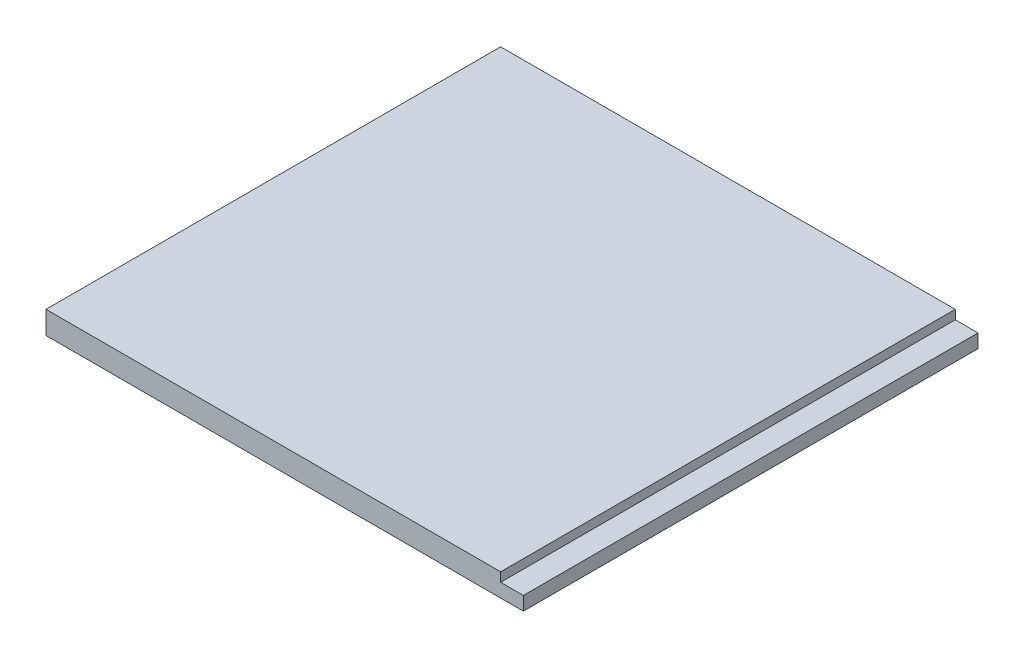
ISO-10303-21;
HEADER;
FILE_DESCRIPTION(('STEP AP214'),'2;1');
FILE_NAME('part.step','',(''),(''),'','','');
FILE_SCHEMA(('AUTOMOTIVE_DESIGN { 1 0 10303 214 1 1 1 1 }'));
ENDSEC;
DATA;
#1=APPLICATION_CONTEXT('core data for automotive mechanical design processes');
#2=APPLICATION_PROTOCOL_DEFINITION('international standard','automotive_design',2000,#1);
#3=PRODUCT_CONTEXT('',#1,'mechanical');
#4=PRODUCT('Part','Part','',(#3));
#5=PRODUCT_RELATED_PRODUCT_CATEGORY('part','',(#4));
#6=PRODUCT_DEFINITION_FORMATION('','',#4);
#7=PRODUCT_DEFINITION_CONTEXT('part definition',#1,'design');
#8=PRODUCT_DEFINITION('design','',#6,#7);
#9=PRODUCT_DEFINITION_SHAPE('','',#8);
#10=(LENGTH_UNIT() NAMED_UNIT(*) SI_UNIT(.MILLI.,.METRE.));
#11=(NAMED_UNIT(*) PLANE_ANGLE_UNIT() SI_UNIT($,.RADIAN.));
#12=(NAMED_UNIT(*) SI_UNIT($,.STERADIAN.) SOLID_ANGLE_UNIT());
#13=UNCERTAINTY_MEASURE_WITH_UNIT(LENGTH_MEASURE(1.E-05),#10,'distance_accuracy_value','');
#14=(GEOMETRIC_REPRESENTATION_CONTEXT(3) GLOBAL_UNCERTAINTY_ASSIGNED_CONTEXT((#13)) GLOBAL_UNIT_ASSIGNED_CONTEXT((#10,
#11,#12)) REPRESENTATION_CONTEXT('',''));
#15=CARTESIAN_POINT('',(0.,0.,0.));
#16=DIRECTION('',(0.,0.,1.));
#17=DIRECTION('',(1.,0.,0.));
#18=AXIS2_PLACEMENT_3D('',#15,#16,#17);
#19=CARTESIAN_POINT('',(1.22464679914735E-13,-1000.,10000.));
#20=DIRECTION('',(0.,1.,0.));
#21=DIRECTION('',(0.,0.,1.));
#22=AXIS2_PLACEMENT_3D('',#19,#20,#21);
#23=PLANE('',#22);
#24=DIRECTION('',(1.,0.,0.));
#25=VECTOR('',#24,1.);
#26=CARTESIAN_POINT('',(1.22464679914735E-13,-1000.,-10000.));
#27=LINE('',#26,#25);
#28=CARTESIAN_POINT('',(1.22464679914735E-13,-1000.,-10000.));
#29=VERTEX_POINT('',#28);
#30=CARTESIAN_POINT('',(21000.,-1000.,-10000.));
#31=VERTEX_POINT('',#30);
#32=EDGE_CURVE('E152',#29,#31,#27,.T.);
#33=ORIENTED_EDGE('',*,*,#32,.T.);
#34=DIRECTION('',(0.,0.,-1.));
#35=VECTOR('',#34,1.);
#36=CARTESIAN_POINT('',(21000.,-1000.,10000.));
#37=LINE('',#36,#35);
#38=CARTESIAN_POINT('',(21000.,-1000.,10000.));
#39=VERTEX_POINT('',#38);
#40=EDGE_CURVE('E137',#39,#31,#37,.T.);
#41=ORIENTED_EDGE('',*,*,#40,.F.);
#42=DIRECTION('',(1.,0.,0.));
#43=VECTOR('',#42,1.);
#44=CARTESIAN_POINT('',(1.22464679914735E-13,-1000.,10000.));
#45=LINE('',#44,#43);
#46=CARTESIAN_POINT('',(1.22464679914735E-13,-1000.,10000.));
#47=VERTEX_POINT('',#46);
#48=EDGE_CURVE('E125',#47,#39,#45,.T.);
#49=ORIENTED_EDGE('',*,*,#48,.F.);
#50=DIRECTION('',(0.,0.,-1.));
#51=VECTOR('',#50,1.);
#52=CARTESIAN_POINT('',(1.22464679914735E-13,-1000.,10000.));
#53=LINE('',#52,#51);
#54=EDGE_CURVE('E162',#47,#29,#53,.T.);
#55=ORIENTED_EDGE('',*,*,#54,.T.);
#56=EDGE_LOOP('',(#33,#41,#49,#55));
#57=FACE_BOUND('',#56,.T.);
#58=CARTESIAN_POINT('',(5352.16897662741,-1000.,-7379.55640049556));
#59=CARTESIAN_POINT('',(5358.21018918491,-1000.,-7391.61646283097));
#60=CARTESIAN_POINT('',(5370.45160175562,-1000.,-7415.695224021));
#61=CARTESIAN_POINT('',(5395.46174029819,-1000.,-7463.47331727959));
#62=CARTESIAN_POINT('',(5427.74635045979,-1000.,-7522.55773510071));
#63=CARTESIAN_POINT('',(5468.06123588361,-1000.,-7592.3462493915));
#64=CARTESIAN_POINT('',(5523.84880853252,-1000.,-7683.84644309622));
#65=CARTESIAN_POINT('',(5597.25963176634,-1000.,-7795.16917318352));
#66=CARTESIAN_POINT('',(5690.76106163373,-1000.,-7923.48728077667));
#67=CARTESIAN_POINT('',(5789.1594403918,-1000.,-8046.22757127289));
#68=CARTESIAN_POINT('',(5926.18417936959,-1000.,-8202.14924887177));
#69=CARTESIAN_POINT('',(6107.05516747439,-1000.,-8382.15540922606));
#70=CARTESIAN_POINT('',(6335.39351275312,-1000.,-8574.07379128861));
#71=CARTESIAN_POINT('',(6571.52797720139,-1000.,-8742.69466088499));
#72=CARTESIAN_POINT('',(6812.6814132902,-1000.,-8889.46900451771));
#73=CARTESIAN_POINT('',(7056.80770920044,-1000.,-9016.20855971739));
#74=CARTESIAN_POINT('',(7302.50638383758,-1000.,-9124.83409286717));
#75=CARTESIAN_POINT('',(7548.89368890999,-1000.,-9217.20929135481));
#76=CARTESIAN_POINT('',(7795.4685042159,-1000.,-9295.0445551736));
#77=CARTESIAN_POINT('',(8041.99387460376,-1000.,-9359.85279388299));
#78=CARTESIAN_POINT('',(8288.40227612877,-1000.,-9412.94374729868));
#79=CARTESIAN_POINT('',(8616.83219639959,-1000.,-9469.58203583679));
#80=CARTESIAN_POINT('',(9027.35480173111,-1000.,-9516.2670119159));
#81=CARTESIAN_POINT('',(9520.70494822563,-1000.,-9539.53348718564));
#82=CARTESIAN_POINT('',(10015.235133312,-1000.,-9534.08550202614));
#83=CARTESIAN_POINT('',(10510.9240952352,-1000.,-9502.85267393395));
#84=CARTESIAN_POINT('',(11007.2879401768,-1000.,-9447.99776160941));
#85=CARTESIAN_POINT('',(11503.447214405,-1000.,-9371.17076714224));
#86=CARTESIAN_POINT('',(11998.2108587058,-1000.,-9273.6604811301));
#87=CARTESIAN_POINT('',(12490.155834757,-1000.,-9156.4870970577));
#88=CARTESIAN_POINT('',(12977.6979204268,-1000.,-9020.45177911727));
#89=CARTESIAN_POINT('',(13459.1536875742,-1000.,-8866.15365810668));
#90=CARTESIAN_POINT('',(13853.8537017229,-1000.,-8722.68040532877));
#91=CARTESIAN_POINT('',(14164.8438112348,-1000.,-8599.03605899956));
#92=CARTESIAN_POINT('',(14395.4894696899,-1000.,-8501.85680552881));
#93=CARTESIAN_POINT('',(14585.358322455,-1000.,-8417.14315681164));
#94=CARTESIAN_POINT('',(14735.7464739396,-1000.,-8347.10641665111));
#95=CARTESIAN_POINT('',(14847.7692454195,-1000.,-8293.43142234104));
#96=CARTESIAN_POINT('',(14958.9586145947,-1000.,-8238.61494774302));
#97=CARTESIAN_POINT('',(15105.804027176,-1000.,-8164.13816756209));
#98=CARTESIAN_POINT('',(15286.8159355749,-1000.,-8068.386700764));
#99=CARTESIAN_POINT('',(15499.8658531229,-1000.,-7949.24914386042));
#100=CARTESIAN_POINT('',(15778.3077932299,-1000.,-7784.74382431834));
#101=CARTESIAN_POINT('',(16115.6412721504,-1000.,-7568.51107575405));
#102=CARTESIAN_POINT('',(16502.6909812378,-1000.,-7292.10509056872));
#103=CARTESIAN_POINT('',(16871.3043711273,-1000.,-6998.86995618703));
#104=CARTESIAN_POINT('',(17220.7203266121,-1000.,-6688.9834152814));
#105=CARTESIAN_POINT('',(17550.1104841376,-1000.,-6362.72488600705));
#106=CARTESIAN_POINT('',(17858.5954879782,-1000.,-6020.49470253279));
#107=CARTESIAN_POINT('',(18145.2669472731,-1000.,-5662.83021544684));
#108=CARTESIAN_POINT('',(18409.2151925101,-1000.,-5290.41619642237));
#109=CARTESIAN_POINT('',(18649.5611989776,-1000.,-4904.08767314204));
#110=CARTESIAN_POINT('',(18865.4902881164,-1000.,-4504.82326707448));
#111=CARTESIAN_POINT('',(19056.2851332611,-1000.,-4093.72990601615));
#112=CARTESIAN_POINT('',(19193.841789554,-1000.,-3742.30001786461));
#113=CARTESIAN_POINT('',(19290.8024719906,-1000.,-3456.48777450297));
#114=CARTESIAN_POINT('',(19345.9205707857,-1000.,-3276.03824869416));
#115=CARTESIAN_POINT('',(19386.7054989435,-1000.,-3130.69011510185));
#116=CARTESIAN_POINT('',(19415.6485959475,-1000.,-3021.15445877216));
#117=CARTESIAN_POINT('',(19442.8787680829,-1000.,-2911.38728726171));
#118=CARTESIAN_POINT('',(19476.9225418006,-1000.,-2764.79012264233));
#119=CARTESIAN_POINT('',(19515.2878033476,-1000.,-2581.13305553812));
#120=CARTESIAN_POINT('',(19567.9540814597,-1000.,-2286.64008814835));
#121=CARTESIAN_POINT('',(19617.8583576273,-1000.,-1917.71470504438));
#122=CARTESIAN_POINT('',(19653.5818427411,-1000.,-1474.80387685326));
#123=CARTESIAN_POINT('',(19666.4224556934,-1000.,-1032.59491612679));
#124=CARTESIAN_POINT('',(19657.5905092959,-1000.,-591.848916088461));
#125=CARTESIAN_POINT('',(19618.4128308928,-1000.,-7.00271869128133));
#126=CARTESIAN_POINT('',(19520.7032562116,-1000.,717.325154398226));
#127=CARTESIAN_POINT('',(19332.7766419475,-1000.,1571.73649485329));
#128=CARTESIAN_POINT('',(19080.1963400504,-1000.,2407.68512513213));
#129=CARTESIAN_POINT('',(18767.9716325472,-1000.,3221.46217048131));
#130=CARTESIAN_POINT('',(18400.2535024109,-1000.,4009.19359983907));
#131=CARTESIAN_POINT('',(18050.4228882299,-1000.,4640.51046706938));
#132=CARTESIAN_POINT('',(17745.8628769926,-1000.,5128.2934731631));
#133=CARTESIAN_POINT('',(17505.3563666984,-1000.,5484.91447624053));
#134=CARTESIAN_POINT('',(17295.0521966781,-1000.,5773.91821773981));
#135=CARTESIAN_POINT('',(17120.963325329,-1000.,5999.90152424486));
#136=CARTESIAN_POINT('',(17009.7405827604,-1000.,6138.89251894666));
#137=CARTESIAN_POINT('',(16919.3068962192,-1000.,6248.70818749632));
#138=CARTESIAN_POINT('',(16850.7858559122,-1000.,6330.33534066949));
#139=CARTESIAN_POINT('',(16781.4256293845,-1000.,6411.38395514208));
#140=CARTESIAN_POINT('',(16687.7611991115,-1000.,6518.70572810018));
#141=CARTESIAN_POINT('',(16568.4439042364,-1000.,6651.39900838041));
#142=CARTESIAN_POINT('',(16372.6030249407,-1000.,6860.41351675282));
#143=CARTESIAN_POINT('',(16118.2791027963,-1000.,7115.1227603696));
#144=CARTESIAN_POINT('',(15797.0655413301,-1000.,7408.95989841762));
#145=CARTESIAN_POINT('',(15459.2014184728,-1000.,7689.52828190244));
#146=CARTESIAN_POINT('',(15104.2594407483,-1000.,7955.27341512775));
#147=CARTESIAN_POINT('',(14732.0455194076,-1000.,8204.58231625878));
#148=CARTESIAN_POINT('',(14342.6160703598,-1000.,8435.84193466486));
#149=CARTESIAN_POINT('',(13936.2743970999,-1000.,8647.50726467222));
#150=CARTESIAN_POINT('',(13583.9967319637,-1000.,8806.39052032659));
#151=CARTESIAN_POINT('',(13294.3224360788,-1000.,8922.39130930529));
#152=CARTESIAN_POINT('',(13073.2372590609,-1000.,9003.71252017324));
#153=CARTESIAN_POINT('',(12848.4208043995,-1000.,9079.23976861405));
#154=CARTESIAN_POINT('',(12677.0842569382,-1000.,9131.46642921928));
#155=CARTESIAN_POINT('',(12561.7558038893,-1000.,9164.41771773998));
#156=CARTESIAN_POINT('',(12484.576599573,-1000.,9185.88582864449));
#157=CARTESIAN_POINT('',(12387.8267537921,-1000.,9211.7137146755));
#158=CARTESIAN_POINT('',(12271.2561736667,-1000.,9241.13523522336));
#159=CARTESIAN_POINT('',(12115.240899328,-1000.,9278.29419675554));
#160=CARTESIAN_POINT('',(11919.1551990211,-1000.,9320.91977506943));
#161=CARTESIAN_POINT('',(11682.2865932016,-1000.,9366.10778711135));
#162=CARTESIAN_POINT('',(11443.9909745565,-1000.,9405.46387374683));
#163=CARTESIAN_POINT('',(11124.5498057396,-1000.,9450.30699966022));
#164=CARTESIAN_POINT('',(10722.3933778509,-1000.,9492.28486172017));
#165=CARTESIAN_POINT('',(10236.420273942,-1000.,9520.65775033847));
#166=CARTESIAN_POINT('',(9748.28662547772,-1000.,9527.30632853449));
#167=CARTESIAN_POINT('',(9259.24902299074,-1000.,9512.30269366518));
#168=CARTESIAN_POINT('',(8770.58515000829,-1000.,9475.5241670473));
#169=CARTESIAN_POINT('',(8283.58335741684,-1000.,9416.65368711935));
#170=CARTESIAN_POINT('',(7799.53610719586,-1000.,9335.16623144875));
#171=CARTESIAN_POINT('',(7319.74056768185,-1000.,9230.30295225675));
#172=CARTESIAN_POINT('',(6845.51134350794,-1000.,9101.03278924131));
#173=CARTESIAN_POINT('',(6378.21262363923,-1000.,8946.00272850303));
#174=CARTESIAN_POINT('',(5919.32045926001,-1000.,8763.48043146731));
#175=CARTESIAN_POINT('',(5470.52967283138,-1000.,8551.29837725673));
#176=CARTESIAN_POINT('',(5033.92385018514,-1000.,8306.82023350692));
#177=CARTESIAN_POINT('',(4612.22286336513,-1000.,8026.96386790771));
#178=CARTESIAN_POINT('',(4209.11899538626,-1000.,7708.35357735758));
#179=CARTESIAN_POINT('',(3892.88356569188,-1000.,7407.76325715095));
#180=CARTESIAN_POINT('',(3655.07627599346,-1000.,7144.95308141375));
#181=CARTESIAN_POINT('',(3485.33276490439,-1000.,6936.50859562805));
#182=CARTESIAN_POINT('',(3325.28875191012,-1000.,6716.67255698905));
#183=CARTESIAN_POINT('',(3176.11396210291,-1000.,6485.56463983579));
#184=CARTESIAN_POINT('',(3061.8676543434,-1000.,6283.84120171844));
#185=CARTESIAN_POINT('',(2977.11317220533,-1000.,6117.24912740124));
#186=CARTESIAN_POINT('',(2917.01429914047,-1000.,5989.78704456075));
#187=CARTESIAN_POINT('',(2860.52448585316,-1000.,5859.90811284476));
#188=CARTESIAN_POINT('',(2816.56721187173,-1000.,5749.74802710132));
#189=CARTESIAN_POINT('',(2783.33945263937,-1000.,5660.54184360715));
#190=CARTESIAN_POINT('',(2759.39047195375,-1000.,5593.07317333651));
#191=CARTESIAN_POINT('',(2736.58784899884,-1000.,5525.55405521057));
#192=CARTESIAN_POINT('',(2707.66190228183,-1000.,5435.41713443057));
#193=CARTESIAN_POINT('',(2674.24526017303,-1000.,5322.61091378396));
#194=CARTESIAN_POINT('',(2638.38921911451,-1000.,5187.14002335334));
#195=CARTESIAN_POINT('',(2606.64144054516,-1000.,5051.67512600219));
#196=CARTESIAN_POINT('',(2569.60937442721,-1000.,4871.18532183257));
#197=CARTESIAN_POINT('',(2532.92323517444,-1000.,4646.0235030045));
#198=CARTESIAN_POINT('',(2503.26889286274,-1000.,4377.06672099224));
#199=CARTESIAN_POINT('',(2487.07465726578,-1000.,4109.7225260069));
#200=CARTESIAN_POINT('',(2482.35448799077,-1000.,3755.78193452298));
#201=CARTESIAN_POINT('',(2506.25792654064,-1000.,3318.61776963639));
#202=CARTESIAN_POINT('',(2578.00156468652,-1000.,2803.65522292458));
#203=CARTESIAN_POINT('',(2670.93756368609,-1000.,2383.36628350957));
#204=CARTESIAN_POINT('',(2764.08519763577,-1000.,2052.97871453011));
#205=CARTESIAN_POINT('',(2843.17097216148,-1000.,1808.26332685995));
#206=CARTESIAN_POINT('',(2931.34566552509,-1000.,1566.78933923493));
#207=CARTESIAN_POINT('',(3028.5302326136,-1000.,1328.74140629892));
#208=CARTESIAN_POINT('',(3117.00119331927,-1000.,1133.39349068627));
#209=CARTESIAN_POINT('',(3192.28034125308,-1000.,979.044411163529));
#210=CARTESIAN_POINT('',(3250.99906980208,-1000.,864.278750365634));
#211=CARTESIAN_POINT('',(3301.8236537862,-1000.,769.497039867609));
#212=CARTESIAN_POINT('',(3343.62459874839,-1000.,694.205006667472));
#213=CARTESIAN_POINT('',(3370.23022746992,-1000.,647.368945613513));
#214=CARTESIAN_POINT('',(3391.79721950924,-1000.,610.046459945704));
#215=CARTESIAN_POINT('',(3413.57580125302,-1000.,572.784205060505));
#216=CARTESIAN_POINT('',(3440.94889487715,-1000.,526.736266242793));
#217=CARTESIAN_POINT('',(3473.99247299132,-1000.,472.338489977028));
#218=CARTESIAN_POINT('',(3518.27728285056,-1000.,400.934221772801));
#219=CARTESIAN_POINT('',(3573.98371160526,-1000.,313.768524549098));
#220=CARTESIAN_POINT('',(3641.17066999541,-1000.,212.424733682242));
#221=CARTESIAN_POINT('',(3708.48621580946,-1000.,114.242585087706));
#222=CARTESIAN_POINT('',(3798.14692035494,-1000.,-12.5814865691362));
#223=CARTESIAN_POINT('',(3909.57137673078,-1000.,-163.700659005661));
#224=CARTESIAN_POINT('',(4040.84727704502,-1000.,-333.980969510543));
#225=CARTESIAN_POINT('',(4168.44373271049,-1000.,-493.95461059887));
#226=CARTESIAN_POINT('',(4332.1687707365,-1000.,-694.402664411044));
#227=CARTESIAN_POINT('',(4522.21370264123,-1000.,-922.367059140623));
#228=CARTESIAN_POINT('',(4686.7635035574,-1000.,-1122.82944089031));
#229=CARTESIAN_POINT('',(4800.31310951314,-1000.,-1267.09514512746));
#230=CARTESIAN_POINT('',(4875.94276670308,-1000.,-1367.12470143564));
#231=CARTESIAN_POINT('',(4941.69936555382,-1000.,-1458.79811007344));
#232=CARTESIAN_POINT('',(4997.47466037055,-1000.,-1541.85746684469));
#233=CARTESIAN_POINT('',(5043.43310591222,-1000.,-1616.05351924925));
#234=CARTESIAN_POINT('',(5080.05837156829,-1000.,-1681.24010421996));
#235=CARTESIAN_POINT('',(5108.17397749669,-1000.,-1737.50636447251));
#236=CARTESIAN_POINT('',(5123.73645506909,-1000.,-1773.3685820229));
#237=CARTESIAN_POINT('',(5132.24080849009,-1000.,-1794.95895078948));
#238=CARTESIAN_POINT('',(5136.1420260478,-1000.,-1805.31559757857));
#239=CARTESIAN_POINT('',(5139.71540295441,-1000.,-1815.25976134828));
#240=CARTESIAN_POINT('',(5142.98166009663,-1000.,-1824.81197309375));
#241=CARTESIAN_POINT('',(5145.97068013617,-1000.,-1834.03021453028));
#242=CARTESIAN_POINT('',(5148.67629244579,-1000.,-1842.8447821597));
#243=CARTESIAN_POINT('',(5151.51844651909,-1000.,-1852.65013518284));
#244=CARTESIAN_POINT('',(5155.39185063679,-1000.,-1866.84652438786));
#245=CARTESIAN_POINT('',(5160.37176851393,-1000.,-1886.82354880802));
#246=CARTESIAN_POINT('',(5166.39440437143,-1000.,-1914.38776395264));
#247=CARTESIAN_POINT('',(5172.30810306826,-1000.,-1945.56606151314));
#248=CARTESIAN_POINT('',(5179.85051074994,-1000.,-1991.92737606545));
#249=CARTESIAN_POINT('',(5188.29016663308,-1000.,-2058.75937544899));
#250=CARTESIAN_POINT('',(5195.92698255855,-1000.,-2152.56253163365));
#251=CARTESIAN_POINT('',(5200.42206088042,-1000.,-2259.1371253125));
#252=CARTESIAN_POINT('',(5201.69532676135,-1000.,-2417.0178260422));
#253=CARTESIAN_POINT('',(5193.87189100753,-1000.,-2641.50511197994));
#254=CARTESIAN_POINT('',(5169.91295660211,-1000.,-2946.82593784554));
#255=CARTESIAN_POINT('',(5133.93516444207,-1000.,-3281.70550411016));
#256=CARTESIAN_POINT('',(5089.70727030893,-1000.,-3641.18471928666));
#257=CARTESIAN_POINT('',(5041.88305240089,-1000.,-4021.85890690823));
#258=CARTESIAN_POINT('',(5003.53814648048,-1000.,-4355.31176577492));
#259=CARTESIAN_POINT('',(4976.99580408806,-1000.,-4631.96371888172));
#260=CARTESIAN_POINT('',(4960.11744780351,-1000.,-4844.66864350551));
#261=CARTESIAN_POINT('',(4947.34177115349,-1000.,-5062.97660885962));
#262=CARTESIAN_POINT('',(4939.93160593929,-1000.,-5287.44148517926));
#263=CARTESIAN_POINT('',(4939.39482039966,-1000.,-5518.76448464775));
#264=CARTESIAN_POINT('',(4947.56899672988,-1000.,-5757.76746400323));
#265=CARTESIAN_POINT('',(4966.72046085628,-1000.,-6005.32359567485));
#266=CARTESIAN_POINT('',(4999.65351153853,-1000.,-6262.21835599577));
#267=CARTESIAN_POINT('',(5041.43937571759,-1000.,-6484.48200780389));
#268=CARTESIAN_POINT('',(5085.5174015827,-1000.,-6667.08354237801));
#269=CARTESIAN_POINT('',(5124.46778553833,-1000.,-6806.28698283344));
#270=CARTESIAN_POINT('',(5169.88861328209,-1000.,-6947.52634689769));
#271=CARTESIAN_POINT('',(5213.62066002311,-1000.,-7066.64972291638));
#272=CARTESIAN_POINT('',(5252.41989223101,-1000.,-7162.57715934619));
#273=CARTESIAN_POINT('',(5283.4922037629,-1000.,-7234.7647769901));
#274=CARTESIAN_POINT('',(5311.08644640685,-1000.,-7295.06545536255));
#275=CARTESIAN_POINT('',(5334.20432641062,-1000.,-7343.33485000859));
#276=CARTESIAN_POINT('',(5346.12776406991,-1000.,-7367.49633816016));
#277=CARTESIAN_POINT('',(5352.16897662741,-1000.,-7379.55640049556));
#278=B_SPLINE_CURVE_WITH_KNOTS('',3,(#58,#59,#60,#61,#62,#63,#64,#65,#66,#67,#68,#69,#70,#71,
#72,#73,#74,#75,#76,#77,#78,#79,#80,#81,#82,#83,#84,#85,#86,#87,#88,#89,#90,#91,#92,#93,#94,#95,
#96,#97,#98,#99,#100,#101,#102,#103,#104,#105,#106,#107,#108,#109,#110,#111,#112,#113,#114,#115,
#116,#117,#118,#119,#120,#121,#122,#123,#124,#125,#126,#127,#128,#129,#130,#131,#132,#133,#134,
#135,#136,#137,#138,#139,#140,#141,#142,#143,#144,#145,#146,#147,#148,#149,#150,#151,#152,#153,
#154,#155,#156,#157,#158,#159,#160,#161,#162,#163,#164,#165,#166,#167,#168,#169,#170,#171,#172,
#173,#174,#175,#176,#177,#178,#179,#180,#181,#182,#183,#184,#185,#186,#187,#188,#189,#190,#191,
#192,#193,#194,#195,#196,#197,#198,#199,#200,#201,#202,#203,#204,#205,#206,#207,#208,#209,#210,
#211,#212,#213,#214,#215,#216,#217,#218,#219,#220,#221,#222,#223,#224,#225,#226,#227,#228,#229,
#230,#231,#232,#233,#234,#235,#236,#237,#238,#239,#240,#241,#242,#243,#244,#245,#246,#247,#248,
#249,#250,#251,#252,#253,#254,#255,#256,#257,#258,#259,#260,#261,#262,#263,#264,#265,#266,#267,
#268,#269,#270,#271,#272,#273,#274,#275,#276,#277),.UNSPECIFIED.,.T.,.F.,(4,1,1,1,1,1,1,1,1,1,1,
1,1,1,1,1,1,1,1,1,1,1,1,1,1,1,1,1,1,1,1,1,1,1,1,1,1,1,1,1,1,1,1,1,1,1,1,1,1,1,1,1,1,1,1,1,1,1,1,
1,1,1,1,1,1,1,1,1,1,1,1,1,1,1,1,1,1,1,1,1,1,1,1,1,1,1,1,1,1,1,1,1,1,1,1,1,1,1,1,1,1,1,1,1,1,1,1,
1,1,1,1,1,1,1,1,1,1,1,1,1,1,1,1,1,1,1,1,1,1,1,1,1,1,1,1,1,1,1,1,1,1,1,1,1,1,1,1,1,1,1,1,1,1,1,1,
1,1,1,1,1,1,1,1,1,1,1,1,1,1,1,1,1,1,1,1,1,1,1,1,1,1,1,1,1,1,1,1,1,1,1,1,1,1,1,1,1,1,1,1,1,1,1,1,
1,1,1,1,1,1,1,1,1,1,1,1,1,1,4),(0.,0.00048828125,0.0009765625,0.001953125,0.0029296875,
0.00390625,0.005859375,0.0078125,0.009765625,0.01171875,0.015625,0.01953125,0.0234375,
0.02734375,0.03125,0.03515625,0.0390625,0.04296875,0.046875,0.05078125,0.0546875,0.0625,
0.0703125,0.078125,0.0859375,0.09375,0.1015625,0.109375,0.1171875,0.125,0.1328125,0.140625,
0.14453125,0.1484375,0.15234375,0.154296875,0.15625,0.158203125,0.16015625,0.1640625,0.16796875,
0.171875,0.1796875,0.1875,0.1953125,0.203125,0.2109375,0.21875,0.2265625,0.234375,0.2421875,
0.25,0.2578125,0.265625,0.26953125,0.2734375,0.275390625,0.27734375,0.279296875,0.28125,
0.28515625,0.2890625,0.296875,0.3046875,0.3125,0.3203125,0.328125,0.34375,0.359375,0.375,
0.390625,0.40625,0.421875,0.4296875,0.4375,0.4453125,0.44921875,0.453125,0.455078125,0.45703125,
0.458984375,0.4609375,0.46484375,0.46875,0.4765625,0.484375,0.4921875,0.5,0.5078125,0.515625,
0.5234375,0.53125,0.53515625,0.5390625,0.54296875,0.546875,0.5478515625,0.548828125,0.55078125,
0.552734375,0.5546875,0.55859375,0.5625,0.56640625,0.5703125,0.578125,0.5859375,0.59375,
0.6015625,0.609375,0.6171875,0.625,0.6328125,0.640625,0.6484375,0.65625,0.6640625,0.671875,
0.6796875,0.6875,0.6953125,0.69921875,0.703125,0.70703125,0.7109375,0.71484375,0.716796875,
0.71875,0.720703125,0.72265625,0.7236328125,0.724609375,0.7255859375,0.7265625,0.728515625,
0.73046875,0.732421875,0.734375,0.73828125,0.7421875,0.74609375,0.75,0.7578125,0.765625,
0.7734375,0.77734375,0.78125,0.78515625,0.7890625,0.79296875,0.794921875,0.796875,0.798828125,
0.7998046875,0.80078125,0.80126953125,0.8017578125,0.802734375,0.8037109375,0.8046875,
0.806640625,0.80859375,0.810546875,0.8125,0.81640625,0.8203125,0.82421875,0.828125,0.8359375,
0.84375,0.84765625,0.8515625,0.85546875,0.859375,0.86328125,0.8671875,0.87109375,0.875,
0.8759765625,0.876953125,0.8779296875,0.87890625,0.8798828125,0.880859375,0.8818359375,
0.8828125,0.884765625,0.88671875,0.888671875,0.890625,0.89453125,0.8984375,0.90234375,0.90625,
0.9140625,0.921875,0.9296875,0.9375,0.9453125,0.953125,0.95703125,0.9609375,0.96484375,0.96875,
0.97265625,0.9765625,0.98046875,0.984375,0.98828125,0.990234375,0.9921875,0.994140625,
0.99609375,0.9970703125,0.998046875,0.9990234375,0.99951171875,1.),.UNSPECIFIED.);
#279=CARTESIAN_POINT('',(5352.16897662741,-1000.,-7379.55640049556));
#280=VERTEX_POINT('',#279);
#281=EDGE_CURVE('E11',#280,#280,#278,.T.);
#282=ORIENTED_EDGE('',*,*,#281,.F.);
#283=EDGE_LOOP('',(#282));
#284=FACE_BOUND('',#283,.T.);
#285=ADVANCED_FACE('F44',(#57,#284),#23,.F.);
#286=ORIENTED_EDGE('',*,*,#281,.T.);
#287=EDGE_LOOP('',(#286));
#288=FACE_BOUND('',#287,.T.);
#289=CARTESIAN_POINT('',(7140.35977118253,-1000.,-6483.80326359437));
#290=CARTESIAN_POINT('',(7940.80177596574,-1000.,-8081.72457200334));
#291=CARTESIAN_POINT('',(14324.614672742,-1000.,-7368.12101818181));
#292=CARTESIAN_POINT('',(18809.6631889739,-1000.,-2127.02828294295));
#293=CARTESIAN_POINT('',(16540.6055915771,-1000.,4524.49091173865));
#294=CARTESIAN_POINT('',(11348.6463392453,-1000.,8368.22781383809));
#295=CARTESIAN_POINT('',(3770.95551060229,-1000.,6935.66672557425));
#296=CARTESIAN_POINT('',(4763.44952772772,-1000.,1288.41489503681));
#297=CARTESIAN_POINT('',(8236.30497755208,-1000.,-1305.53760088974));
#298=CARTESIAN_POINT('',(6529.1983141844,-1000.,-5263.74246071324));
#299=CARTESIAN_POINT('',(7140.35977118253,-1000.,-6483.80326359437));
#300=B_SPLINE_CURVE_WITH_KNOTS('',3,(#289,#290,#291,#292,#293,#294,#295,#296,#297,#298,#299),
.UNSPECIFIED.,.T.,.F.,(4,1,1,1,1,1,1,1,4),(0.,0.156717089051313,0.276765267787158,
0.456613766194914,0.548245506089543,0.724112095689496,0.801593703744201,0.880341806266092,1.),.UNSPECIFIED.);
#301=CARTESIAN_POINT('',(7140.35977118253,-1000.,-6483.80326359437));
#302=VERTEX_POINT('',#301);
#303=EDGE_CURVE('E56',#302,#302,#300,.T.);
#304=ORIENTED_EDGE('',*,*,#303,.F.);
#305=EDGE_LOOP('',(#304));
#306=FACE_BOUND('',#305,.T.);
#307=ADVANCED_FACE('F180',(#288,#306),#23,.F.);
#308=ORIENTED_EDGE('',*,*,#303,.T.);
#309=EDGE_LOOP('',(#308));
#310=FACE_BOUND('',#309,.T.);
#311=DIRECTION('',(0.,0.,1.));
#312=VECTOR('',#311,1.);
#313=CARTESIAN_POINT('',(14900.,-1000.,199.999999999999));
#314=LINE('',#313,#312);
#315=CARTESIAN_POINT('',(14900.,-1000.,-200.000000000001));
#316=VERTEX_POINT('',#315);
#317=CARTESIAN_POINT('',(14900.,-1000.,199.999999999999));
#318=VERTEX_POINT('',#317);
#319=EDGE_CURVE('E63',#316,#318,#314,.T.);
#320=ORIENTED_EDGE('',*,*,#319,.T.);
#321=DIRECTION('',(1.,0.,0.));
#322=VECTOR('',#321,1.);
#323=CARTESIAN_POINT('',(14900.,-1000.,199.999999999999));
#324=LINE('',#323,#322);
#325=CARTESIAN_POINT('',(15000.,-1000.,199.999999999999));
#326=VERTEX_POINT('',#325);
#327=EDGE_CURVE('E238',#318,#326,#324,.T.);
#328=ORIENTED_EDGE('',*,*,#327,.T.);
#329=DIRECTION('',(0.,0.,-1.));
#330=VECTOR('',#329,1.);
#331=CARTESIAN_POINT('',(15000.,-1000.,199.999999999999));
#332=LINE('',#331,#330);
#333=CARTESIAN_POINT('',(15000.,-1000.,50.));
#334=VERTEX_POINT('',#333);
#335=EDGE_CURVE('E235',#326,#334,#332,.T.);
#336=ORIENTED_EDGE('',*,*,#335,.T.);
#337=CARTESIAN_POINT('',(15000.,-1000.,0.));
#338=DIRECTION('',(0.,1.,0.));
#339=DIRECTION('',(0.,0.,1.));
#340=AXIS2_PLACEMENT_3D('',#337,#338,#339);
#341=CIRCLE('',#340,50.);
#342=CARTESIAN_POINT('',(15000.,-1000.,-50.));
#343=VERTEX_POINT('',#342);
#344=EDGE_CURVE('E232',#334,#343,#341,.T.);
#345=ORIENTED_EDGE('',*,*,#344,.T.);
#346=DIRECTION('',(0.,0.,-1.));
#347=VECTOR('',#346,1.);
#348=CARTESIAN_POINT('',(15000.,-1000.,-50.));
#349=LINE('',#348,#347);
#350=CARTESIAN_POINT('',(15000.,-1000.,-200.000000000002));
#351=VERTEX_POINT('',#350);
#352=EDGE_CURVE('E229',#343,#351,#349,.T.);
#353=ORIENTED_EDGE('',*,*,#352,.T.);
#354=DIRECTION('',(-1.,0.,0.));
#355=VECTOR('',#354,1.);
#356=CARTESIAN_POINT('',(14900.,-1000.,-200.000000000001));
#357=LINE('',#356,#355);
#358=EDGE_CURVE('E225',#351,#316,#357,.T.);
#359=ORIENTED_EDGE('',*,*,#358,.T.);
#360=EDGE_LOOP('',(#320,#328,#336,#345,#353,#359));
#361=FACE_BOUND('',#360,.T.);
#362=ADVANCED_FACE('F177',(#310,#361),#23,.F.);
#363=CARTESIAN_POINT('',(20000.,0.,10000.));
#364=DIRECTION('',(0.,-1.,0.));
#365=DIRECTION('',(0.,0.,-1.));
#366=AXIS2_PLACEMENT_3D('',#363,#364,#365);
#367=PLANE('',#366);
#368=DIRECTION('',(-1.,0.,0.));
#369=VECTOR('',#368,1.);
#370=CARTESIAN_POINT('',(20000.,0.,-10000.));
#371=LINE('',#370,#369);
#372=CARTESIAN_POINT('',(20000.,0.,-10000.));
#373=VERTEX_POINT('',#372);
#374=CARTESIAN_POINT('',(0.,0.,-10000.));
#375=VERTEX_POINT('',#374);
#376=EDGE_CURVE('E146',#373,#375,#371,.T.);
#377=ORIENTED_EDGE('',*,*,#376,.T.);
#378=DIRECTION('',(0.,0.,-1.));
#379=VECTOR('',#378,1.);
#380=CARTESIAN_POINT('',(0.,0.,10000.));
#381=LINE('',#380,#379);
#382=CARTESIAN_POINT('',(0.,0.,10000.));
#383=VERTEX_POINT('',#382);
#384=EDGE_CURVE('E165',#383,#375,#381,.T.);
#385=ORIENTED_EDGE('',*,*,#384,.F.);
#386=DIRECTION('',(-1.,0.,0.));
#387=VECTOR('',#386,1.);
#388=CARTESIAN_POINT('',(20000.,0.,10000.));
#389=LINE('',#388,#387);
#390=CARTESIAN_POINT('',(20000.,0.,10000.));
#391=VERTEX_POINT('',#390);
#392=EDGE_CURVE('E158',#391,#383,#389,.T.);
#393=ORIENTED_EDGE('',*,*,#392,.F.);
#394=DIRECTION('',(0.,0.,-1.));
#395=VECTOR('',#394,1.);
#396=CARTESIAN_POINT('',(20000.,0.,10000.));
#397=LINE('',#396,#395);
#398=EDGE_CURVE('E142',#391,#373,#397,.T.);
#399=ORIENTED_EDGE('',*,*,#398,.T.);
#400=EDGE_LOOP('',(#377,#385,#393,#399));
#401=FACE_BOUND('',#400,.T.);
#402=ADVANCED_FACE('F47',(#401),#367,.F.);
#403=CARTESIAN_POINT('',(0.,0.,10000.));
#404=DIRECTION('',(1.,0.,0.));
#405=DIRECTION('',(0.,1.,0.));
#406=AXIS2_PLACEMENT_3D('',#403,#404,#405);
#407=PLANE('',#406);
#408=DIRECTION('',(0.,-1.,0.));
#409=VECTOR('',#408,1.);
#410=CARTESIAN_POINT('',(0.,0.,-10000.));
#411=LINE('',#410,#409);
#412=EDGE_CURVE('E149',#375,#29,#411,.T.);
#413=ORIENTED_EDGE('',*,*,#412,.T.);
#414=ORIENTED_EDGE('',*,*,#54,.F.);
#415=DIRECTION('',(0.,-1.,0.));
#416=VECTOR('',#415,1.);
#417=CARTESIAN_POINT('',(0.,0.,10000.));
#418=LINE('',#417,#416);
#419=EDGE_CURVE('E108',#383,#47,#418,.T.);
#420=ORIENTED_EDGE('',*,*,#419,.F.);
#421=ORIENTED_EDGE('',*,*,#384,.T.);
#422=EDGE_LOOP('',(#413,#414,#420,#421));
#423=FACE_BOUND('',#422,.T.);
#424=ADVANCED_FACE('F191',(#423),#407,.F.);
#425=CARTESIAN_POINT('',(21000.,-1000.,10000.));
#426=DIRECTION('',(-1.,0.,0.));
#427=DIRECTION('',(0.,0.,1.));
#428=AXIS2_PLACEMENT_3D('',#425,#426,#427);
#429=PLANE('',#428);
#430=DIRECTION('',(0.,1.,0.));
#431=VECTOR('',#430,1.);
#432=CARTESIAN_POINT('',(21000.,-1000.,-10000.));
#433=LINE('',#432,#431);
#434=CARTESIAN_POINT('',(21000.,-400.,-10000.));
#435=VERTEX_POINT('',#434);
#436=EDGE_CURVE('E134',#31,#435,#433,.T.);
#437=ORIENTED_EDGE('',*,*,#436,.T.);
#438=DIRECTION('',(0.,0.,-1.));
#439=VECTOR('',#438,1.);
#440=CARTESIAN_POINT('',(21000.,-400.,10000.));
#441=LINE('',#440,#439);
#442=CARTESIAN_POINT('',(21000.,-400.,10000.));
#443=VERTEX_POINT('',#442);
#444=EDGE_CURVE('E131',#443,#435,#441,.T.);
#445=ORIENTED_EDGE('',*,*,#444,.F.);
#446=DIRECTION('',(0.,1.,0.));
#447=VECTOR('',#446,1.);
#448=CARTESIAN_POINT('',(21000.,-1000.,10000.));
#449=LINE('',#448,#447);
#450=EDGE_CURVE('E118',#39,#443,#449,.T.);
#451=ORIENTED_EDGE('',*,*,#450,.F.);
#452=ORIENTED_EDGE('',*,*,#40,.T.);
#453=EDGE_LOOP('',(#437,#445,#451,#452));
#454=FACE_BOUND('',#453,.T.);
#455=ADVANCED_FACE('F132',(#454),#429,.F.);
#456=CARTESIAN_POINT('',(20000.,-400.,10000.));
#457=DIRECTION('',(0.,-1.,0.));
#458=DIRECTION('',(1.,0.,0.));
#459=AXIS2_PLACEMENT_3D('',#456,#457,#458);
#460=PLANE('',#459);
#461=DIRECTION('',(-1.,0.,0.));
#462=VECTOR('',#461,1.);
#463=CARTESIAN_POINT('',(20000.,-400.,-10000.));
#464=LINE('',#463,#462);
#465=CARTESIAN_POINT('',(20000.,-400.,-10000.));
#466=VERTEX_POINT('',#465);
#467=EDGE_CURVE('E155',#435,#466,#464,.T.);
#468=ORIENTED_EDGE('',*,*,#467,.T.);
#469=DIRECTION('',(0.,0.,-1.));
#470=VECTOR('',#469,1.);
#471=CARTESIAN_POINT('',(20000.,-400.,10000.));
#472=LINE('',#471,#470);
#473=CARTESIAN_POINT('',(20000.,-400.,10000.));
#474=VERTEX_POINT('',#473);
#475=EDGE_CURVE('E138',#474,#466,#472,.T.);
#476=ORIENTED_EDGE('',*,*,#475,.F.);
#477=DIRECTION('',(-1.,0.,0.));
#478=VECTOR('',#477,1.);
#479=CARTESIAN_POINT('',(20000.,-400.,10000.));
#480=LINE('',#479,#478);
#481=EDGE_CURVE('E122',#443,#474,#480,.T.);
#482=ORIENTED_EDGE('',*,*,#481,.F.);
#483=ORIENTED_EDGE('',*,*,#444,.T.);
#484=EDGE_LOOP('',(#468,#476,#482,#483));
#485=FACE_BOUND('',#484,.T.);
#486=ADVANCED_FACE('F140',(#485),#460,.F.);
#487=CARTESIAN_POINT('',(20000.,0.,10000.));
#488=DIRECTION('',(-1.,0.,0.));
#489=DIRECTION('',(0.,0.,1.));
#490=AXIS2_PLACEMENT_3D('',#487,#488,#489);
#491=PLANE('',#490);
#492=DIRECTION('',(0.,1.,0.));
#493=VECTOR('',#492,1.);
#494=CARTESIAN_POINT('',(20000.,0.,-10000.));
#495=LINE('',#494,#493);
#496=EDGE_CURVE('E99',#466,#373,#495,.T.);
#497=ORIENTED_EDGE('',*,*,#496,.T.);
#498=ORIENTED_EDGE('',*,*,#398,.F.);
#499=DIRECTION('',(0.,1.,0.));
#500=VECTOR('',#499,1.);
#501=CARTESIAN_POINT('',(20000.,0.,10000.));
#502=LINE('',#501,#500);
#503=EDGE_CURVE('E72',#474,#391,#502,.T.);
#504=ORIENTED_EDGE('',*,*,#503,.F.);
#505=ORIENTED_EDGE('',*,*,#475,.T.);
#506=EDGE_LOOP('',(#497,#498,#504,#505));
#507=FACE_BOUND('',#506,.T.);
#508=ADVANCED_FACE('F204',(#507),#491,.F.);
#509=CARTESIAN_POINT('',(0.,0.,10000.));
#510=DIRECTION('',(0.,0.,1.));
#511=DIRECTION('',(1.,0.,0.));
#512=AXIS2_PLACEMENT_3D('',#509,#510,#511);
#513=PLANE('',#512);
#514=ORIENTED_EDGE('',*,*,#392,.T.);
#515=ORIENTED_EDGE('',*,*,#419,.T.);
#516=ORIENTED_EDGE('',*,*,#48,.T.);
#517=ORIENTED_EDGE('',*,*,#450,.T.);
#518=ORIENTED_EDGE('',*,*,#481,.T.);
#519=ORIENTED_EDGE('',*,*,#503,.T.);
#520=EDGE_LOOP('',(#514,#515,#516,#517,#518,#519));
#521=FACE_BOUND('',#520,.T.);
#522=ADVANCED_FACE('F120',(#521),#513,.T.);
#523=CARTESIAN_POINT('',(0.,0.,-10000.));
#524=DIRECTION('',(0.,0.,1.));
#525=DIRECTION('',(1.,0.,0.));
#526=AXIS2_PLACEMENT_3D('',#523,#524,#525);
#527=PLANE('',#526);
#528=ORIENTED_EDGE('',*,*,#376,.F.);
#529=ORIENTED_EDGE('',*,*,#496,.F.);
#530=ORIENTED_EDGE('',*,*,#467,.F.);
#531=ORIENTED_EDGE('',*,*,#436,.F.);
#532=ORIENTED_EDGE('',*,*,#32,.F.);
#533=ORIENTED_EDGE('',*,*,#412,.F.);
#534=EDGE_LOOP('',(#528,#529,#530,#531,#532,#533));
#535=FACE_BOUND('',#534,.T.);
#536=ADVANCED_FACE('F203',(#535),#527,.F.);
#537=CARTESIAN_POINT('',(14900.,-900.,199.999999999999));
#538=DIRECTION('',(1.,0.,0.));
#539=DIRECTION('',(0.,0.,-1.));
#540=AXIS2_PLACEMENT_3D('',#537,#538,#539);
#541=PLANE('',#540);
#542=ORIENTED_EDGE('',*,*,#319,.F.);
#543=DIRECTION('',(0.,-1.,0.));
#544=VECTOR('',#543,1.);
#545=CARTESIAN_POINT('',(14900.,-900.,-200.000000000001));
#546=LINE('',#545,#544);
#547=CARTESIAN_POINT('',(14900.,-900.,-200.000000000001));
#548=VERTEX_POINT('',#547);
#549=EDGE_CURVE('E222',#548,#316,#546,.T.);
#550=ORIENTED_EDGE('',*,*,#549,.F.);
#551=DIRECTION('',(0.,0.,1.));
#552=VECTOR('',#551,1.);
#553=CARTESIAN_POINT('',(14900.,-900.,199.999999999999));
#554=LINE('',#553,#552);
#555=CARTESIAN_POINT('',(14900.,-900.,199.999999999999));
#556=VERTEX_POINT('',#555);
#557=EDGE_CURVE('E228',#548,#556,#554,.T.);
#558=ORIENTED_EDGE('',*,*,#557,.T.);
#559=DIRECTION('',(0.,-1.,0.));
#560=VECTOR('',#559,1.);
#561=CARTESIAN_POINT('',(14900.,-900.,199.999999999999));
#562=LINE('',#561,#560);
#563=EDGE_CURVE('E150',#556,#318,#562,.T.);
#564=ORIENTED_EDGE('',*,*,#563,.T.);
#565=EDGE_LOOP('',(#542,#550,#558,#564));
#566=FACE_BOUND('',#565,.T.);
#567=ADVANCED_FACE('F260',(#566),#541,.T.);
#568=CARTESIAN_POINT('',(14900.,-900.,199.999999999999));
#569=DIRECTION('',(0.,0.,-1.));
#570=DIRECTION('',(-1.,0.,0.));
#571=AXIS2_PLACEMENT_3D('',#568,#569,#570);
#572=PLANE('',#571);
#573=ORIENTED_EDGE('',*,*,#327,.F.);
#574=ORIENTED_EDGE('',*,*,#563,.F.);
#575=DIRECTION('',(1.,0.,0.));
#576=VECTOR('',#575,1.);
#577=CARTESIAN_POINT('',(14900.,-900.,199.999999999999));
#578=LINE('',#577,#576);
#579=CARTESIAN_POINT('',(15000.,-900.,199.999999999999));
#580=VERTEX_POINT('',#579);
#581=EDGE_CURVE('E253',#556,#580,#578,.T.);
#582=ORIENTED_EDGE('',*,*,#581,.T.);
#583=DIRECTION('',(0.,-1.,0.));
#584=VECTOR('',#583,1.);
#585=CARTESIAN_POINT('',(15000.,-900.,199.999999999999));
#586=LINE('',#585,#584);
#587=EDGE_CURVE('E210',#580,#326,#586,.T.);
#588=ORIENTED_EDGE('',*,*,#587,.T.);
#589=EDGE_LOOP('',(#573,#574,#582,#588));
#590=FACE_BOUND('',#589,.T.);
#591=ADVANCED_FACE('F269',(#590),#572,.T.);
#592=CARTESIAN_POINT('',(15000.,-900.,199.999999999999));
#593=DIRECTION('',(-1.,0.,0.));
#594=DIRECTION('',(0.,0.,1.));
#595=AXIS2_PLACEMENT_3D('',#592,#593,#594);
#596=PLANE('',#595);
#597=ORIENTED_EDGE('',*,*,#335,.F.);
#598=ORIENTED_EDGE('',*,*,#587,.F.);
#599=DIRECTION('',(0.,0.,-1.));
#600=VECTOR('',#599,1.);
#601=CARTESIAN_POINT('',(15000.,-900.,199.999999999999));
#602=LINE('',#601,#600);
#603=CARTESIAN_POINT('',(15000.,-900.,50.));
#604=VERTEX_POINT('',#603);
#605=EDGE_CURVE('E250',#580,#604,#602,.T.);
#606=ORIENTED_EDGE('',*,*,#605,.T.);
#607=DIRECTION('',(0.,-1.,0.));
#608=VECTOR('',#607,1.);
#609=CARTESIAN_POINT('',(15000.,-900.,50.));
#610=LINE('',#609,#608);
#611=EDGE_CURVE('E213',#604,#334,#610,.T.);
#612=ORIENTED_EDGE('',*,*,#611,.T.);
#613=EDGE_LOOP('',(#597,#598,#606,#612));
#614=FACE_BOUND('',#613,.T.);
#615=ADVANCED_FACE('F303',(#614),#596,.T.);
#616=CARTESIAN_POINT('',(15000.,-900.,0.));
#617=DIRECTION('',(0.,-1.,0.));
#618=DIRECTION('',(0.,0.,-1.));
#619=AXIS2_PLACEMENT_3D('',#616,#617,#618);
#620=CYLINDRICAL_SURFACE('',#619,50.);
#621=ORIENTED_EDGE('',*,*,#344,.F.);
#622=ORIENTED_EDGE('',*,*,#611,.F.);
#623=CARTESIAN_POINT('',(15000.,-900.,0.));
#624=DIRECTION('',(0.,1.,0.));
#625=DIRECTION('',(0.,0.,1.));
#626=AXIS2_PLACEMENT_3D('',#623,#624,#625);
#627=CIRCLE('',#626,50.);
#628=CARTESIAN_POINT('',(15000.,-900.,-50.));
#629=VERTEX_POINT('',#628);
#630=EDGE_CURVE('E247',#604,#629,#627,.T.);
#631=ORIENTED_EDGE('',*,*,#630,.T.);
#632=DIRECTION('',(0.,-1.,0.));
#633=VECTOR('',#632,1.);
#634=CARTESIAN_POINT('',(15000.,-900.,-50.));
#635=LINE('',#634,#633);
#636=EDGE_CURVE('E216',#629,#343,#635,.T.);
#637=ORIENTED_EDGE('',*,*,#636,.T.);
#638=EDGE_LOOP('',(#621,#622,#631,#637));
#639=FACE_BOUND('',#638,.T.);
#640=ADVANCED_FACE('F292',(#639),#620,.F.);
#641=CARTESIAN_POINT('',(15000.,-900.,-50.));
#642=DIRECTION('',(-1.,0.,0.));
#643=DIRECTION('',(0.,0.,1.));
#644=AXIS2_PLACEMENT_3D('',#641,#642,#643);
#645=PLANE('',#644);
#646=ORIENTED_EDGE('',*,*,#352,.F.);
#647=ORIENTED_EDGE('',*,*,#636,.F.);
#648=DIRECTION('',(0.,0.,-1.));
#649=VECTOR('',#648,1.);
#650=CARTESIAN_POINT('',(15000.,-900.,-50.));
#651=LINE('',#650,#649);
#652=CARTESIAN_POINT('',(15000.,-900.,-200.000000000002));
#653=VERTEX_POINT('',#652);
#654=EDGE_CURVE('E244',#629,#653,#651,.T.);
#655=ORIENTED_EDGE('',*,*,#654,.T.);
#656=DIRECTION('',(0.,-1.,0.));
#657=VECTOR('',#656,1.);
#658=CARTESIAN_POINT('',(15000.,-900.,-200.000000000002));
#659=LINE('',#658,#657);
#660=EDGE_CURVE('E219',#653,#351,#659,.T.);
#661=ORIENTED_EDGE('',*,*,#660,.T.);
#662=EDGE_LOOP('',(#646,#647,#655,#661));
#663=FACE_BOUND('',#662,.T.);
#664=ADVANCED_FACE('F286',(#663),#645,.T.);
#665=CARTESIAN_POINT('',(14900.,-900.,-200.000000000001));
#666=DIRECTION('',(0.,0.,1.));
#667=DIRECTION('',(1.,0.,0.));
#668=AXIS2_PLACEMENT_3D('',#665,#666,#667);
#669=PLANE('',#668);
#670=ORIENTED_EDGE('',*,*,#358,.F.);
#671=ORIENTED_EDGE('',*,*,#660,.F.);
#672=DIRECTION('',(-1.,0.,0.));
#673=VECTOR('',#672,1.);
#674=CARTESIAN_POINT('',(14900.,-900.,-200.000000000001));
#675=LINE('',#674,#673);
#676=EDGE_CURVE('E224',#653,#548,#675,.T.);
#677=ORIENTED_EDGE('',*,*,#676,.T.);
#678=ORIENTED_EDGE('',*,*,#549,.T.);
#679=EDGE_LOOP('',(#670,#671,#677,#678));
#680=FACE_BOUND('',#679,.T.);
#681=ADVANCED_FACE('F290',(#680),#669,.T.);
#682=CARTESIAN_POINT('',(15000.,-900.,0.));
#683=DIRECTION('',(0.,1.,0.));
#684=DIRECTION('',(0.,0.,1.));
#685=AXIS2_PLACEMENT_3D('',#682,#683,#684);
#686=PLANE('',#685);
#687=ORIENTED_EDGE('',*,*,#557,.F.);
#688=ORIENTED_EDGE('',*,*,#676,.F.);
#689=ORIENTED_EDGE('',*,*,#654,.F.);
#690=ORIENTED_EDGE('',*,*,#630,.F.);
#691=ORIENTED_EDGE('',*,*,#605,.F.);
#692=ORIENTED_EDGE('',*,*,#581,.F.);
#693=EDGE_LOOP('',(#687,#688,#689,#690,#691,#692));
#694=FACE_BOUND('',#693,.T.);
#695=ADVANCED_FACE('F299',(#694),#686,.F.);
#696=CLOSED_SHELL('',(#285,#307,#362,#402,#424,#455,#486,#508,#522,#536,#567,#591,#615,#640,
#664,#681,#695));
#697=MANIFOLD_SOLID_BREP('B2',#696);
#698=ADVANCED_BREP_SHAPE_REPRESENTATION('',(#18,#697),#14);
#699=SHAPE_DEFINITION_REPRESENTATION(#9,#698);
ENDSEC;
END-ISO-10303-21;
